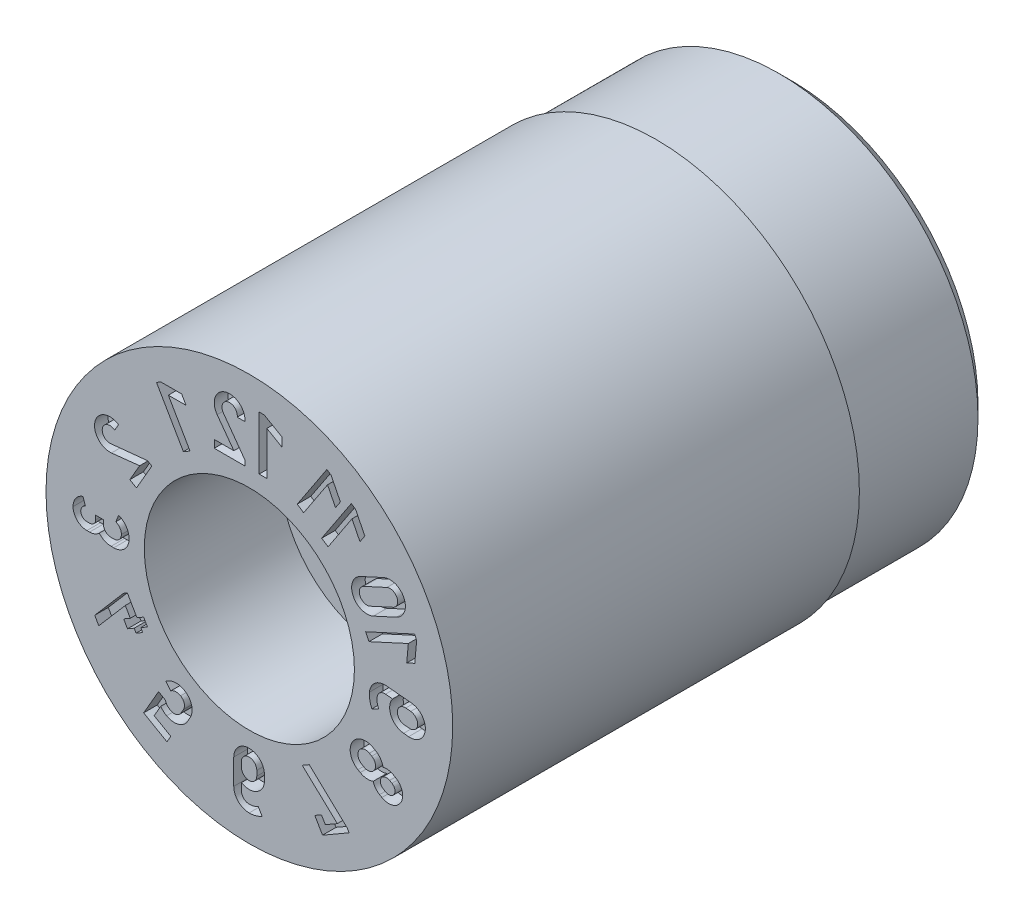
from build123d import *

# Parameters (mm, degrees)
SKETCH4_W          = 2
SKETCH4_H          = 1
CUT_EXTRUDE1_DEPTH = 0.2


with BuildPart() as part:
    # Sketch1 → Revolve1 (revolve)
    with BuildSketch(Plane(origin=(0, 0, 0), x_dir=(0, 0, -1), z_dir=(1, 0, 0)), mode=Mode.PRIVATE) as revolve1_sk:
        Polygon((0, 3), (0, 1.55), (2, 1.55), (2, 0.8), (8, 0.8), (8, 2.75), (7.75, 3), align=None)
    revolve(revolve1_sk.sketch.rotate(Axis((0, 0, 3.797909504), (0, 0, -1)), 90), axis=Axis((0, 0, 3.797909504), (0, 0, -1)))

    # Sketch4 → Cut-Revolve1 (revolve, cut)
    with BuildSketch(Plane(origin=(0, 0, 0), x_dir=(0, 0, -1), z_dir=(1, 0, 0)), mode=Mode.PRIVATE) as cut_revolve1_sk:
        with Locations((7, 3.435)):
            Rectangle(SKETCH4_W, SKETCH4_H)
    revolve(cut_revolve1_sk.sketch.rotate(Axis((0, 0, 0), (0, 0, -1)), 90), axis=Axis((0, 0, 0), (0, 0, -1)), mode=Mode.SUBTRACT)

    # Sketch2 → Cut-Extrude1 (cut)
    # profile 1 of 15: a face of its own
    with BuildSketch(Plane.XY):
        Polygon((1.504540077, 2.099663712), (1.56676782, 2.05853547), (1.703996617, 1.784946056), (1.631939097, 1.675921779), (1.514703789, 1.909561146), (1.161711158, 1.375477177), (1.067191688, 1.437948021), align=None)
    # profile 2 of 15: a face of its own
    with BuildSketch(Plane.XY):
        Polygon((1.143710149, 2.354168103), (1.205937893, 2.31303986), (1.34316669, 2.039450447), (1.27110917, 1.93042617), (1.153873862, 2.164065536), (0.80088123, 1.629981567), (0.706361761, 1.692452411), align=None)
    # profile 3 of 15: a face of its own
    with BuildSketch(Plane.XY):
        with BuildLine():
            Line((2.391484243, -0.005118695), (2.019163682, 0.029559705))
            ThreePointArc((2.019163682, 0.029559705), (1.853456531, -0.021646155), (1.772455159, -0.175007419))
            ThreePointArc((1.772455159, -0.175007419), (1.776698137, -0.275805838), (1.807754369, -0.371794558))
            Line((1.807754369, -0.371794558), (1.910064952, -0.322612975))
            ThreePointArc((1.910064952, -0.322612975), (1.886093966, -0.251740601), (1.886419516, -0.176924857))
            ThreePointArc((1.886419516, -0.176924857), (1.929158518, -0.106137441), (2.008617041, -0.083250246))
            Line((2.008617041, -0.083250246), (2.112173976, -0.092922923))
            ThreePointArc((2.112173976, -0.092922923), (2.090630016, -0.318872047), (2.276014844, -0.449828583))
            Line((2.276014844, -0.449828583), (2.349218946, -0.456404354))
            ThreePointArc((2.349218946, -0.456404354), (2.595994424, -0.251894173), (2.391484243, -0.005118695))
        make_face()
        with BuildLine():
            Line((2.380951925, -0.117990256), (2.307631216, -0.111148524))
            ThreePointArc((2.307631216, -0.111148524), (2.184278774, -0.213448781), (2.286583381, -0.336797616))
            Line((2.286583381, -0.336797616), (2.359888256, -0.343637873))
            ThreePointArc((2.359888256, -0.343637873), (2.483243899, -0.241345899), (2.380951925, -0.117990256))
        make_face(mode=Mode.SUBTRACT)
    # profile 4 of 15: a face of its own
    with BuildSketch(Plane.XY):
        Polygon((0.780813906, -1.606569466), (0.883247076, -1.547429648), (1.444601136, -2.076428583), (1.471791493, -2.123523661), (1.079259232, -2.350152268), (0.965944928, -2.153886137), (1.064091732, -2.097221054), (1.120740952, -2.195340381), (1.297361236, -2.093368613), align=None)
    # profile 5 of 15: a face of its own
    with BuildSketch(Plane.XY):
        with BuildLine():
            Line((1.862289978, -0.878798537), (1.827973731, -0.858949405))
            ThreePointArc((1.827973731, -0.858949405), (1.518236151, -0.941810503), (1.601345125, -1.251481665))
            Line((1.601345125, -1.251481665), (1.635665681, -1.271296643))
            ThreePointArc((1.635665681, -1.271296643), (1.729541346, -1.300831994), (1.827084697, -1.287783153))
            ThreePointArc((1.827084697, -1.287783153), (1.862355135, -1.358397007), (1.921768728, -1.410361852))
            Line((1.921768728, -1.410361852), (1.956123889, -1.430163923))
            ThreePointArc((1.956123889, -1.430163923), (2.234666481, -1.355512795), (2.160015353, -1.076970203))
            Line((2.160015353, -1.076970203), (2.125744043, -1.057037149))
            ThreePointArc((2.125744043, -1.057037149), (2.05107211, -1.031419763), (1.972280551, -1.03632264))
            ThreePointArc((1.972280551, -1.03632264), (1.934803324, -0.945328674), (1.862289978, -0.878798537))
        make_face()
        with BuildLine():
            Line((1.978413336, -1.312240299), (2.01276804, -1.332038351))
            ThreePointArc((2.01276804, -1.332038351), (2.136591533, -1.298859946), (2.103413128, -1.175036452))
            Line((2.103413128, -1.175036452), (2.06909016, -1.155183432))
            ThreePointArc((2.06909016, -1.155183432), (1.945097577, -1.188300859), (1.978413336, -1.312240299))
        make_face(mode=Mode.SUBTRACT)
        with BuildLine():
            Line((1.657975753, -1.153356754), (1.692347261, -1.173201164))
            ThreePointArc((1.692347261, -1.173201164), (1.847111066, -1.131713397), (1.8056233, -0.976949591))
            Line((1.8056233, -0.976949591), (1.77130591, -0.957063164))
            ThreePointArc((1.77130591, -0.957063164), (1.616535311, -0.99856871), (1.657975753, -1.153356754))
        make_face(mode=Mode.SUBTRACT)
    # profile 6 of 15: a face of its own
    with BuildSketch(Plane.XY):
        Polygon((2.437380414, 0.898792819), (2.468512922, 0.831009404), (2.440605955, 0.526207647), (2.321848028, 0.471662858), (2.345641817, 0.731980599), (1.763875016, 0.464778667), (1.716586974, 0.567736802), align=None)
    # profile 7 of 15: a face of its own
    with BuildSketch(Plane.XY):
        with BuildLine():
            Line((1.980886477, 1.392370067), (1.641083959, 1.236300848))
            ThreePointArc((1.641083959, 1.236300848), (1.52969504, 0.935721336), (1.830280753, 0.824349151))
            Line((1.830280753, 0.824349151), (2.170091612, 0.9804222))
            ThreePointArc((2.170091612, 0.9804222), (2.281462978, 1.280998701), (1.980886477, 1.392370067))
        make_face()
        with BuildLine():
            Line((1.782979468, 0.927336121), (2.122790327, 1.08340917))
            ThreePointArc((2.122790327, 1.08340917), (2.178476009, 1.233697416), (2.028187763, 1.289383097))
            Line((2.028187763, 1.289383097), (1.688369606, 1.133306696))
            ThreePointArc((1.688369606, 1.133306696), (1.632685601, 0.983014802), (1.782979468, 0.927336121))
        make_face(mode=Mode.SUBTRACT)
    # profile 8 of 15: a face of its own
    with BuildSketch(Plane.XY):
        Polygon((0.145054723, 2.589659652), (0.219645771, 2.589659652), (0.484981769, 2.437082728), (0.484981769, 2.306397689), (0.258353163, 2.436670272), (0.258353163, 1.796475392), (0.145054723, 1.796475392), align=None)
    # profile 9 of 15: a face of its own
    with BuildSketch(Plane.XY):
        with BuildLine():
            Line((-0.517439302, 1.794737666), (-0.064182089, 1.794737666))
            Line((-0.064182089, 1.794737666), (-0.064182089, 1.869677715))
            Line((-0.064182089, 1.869677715), (-0.38282007, 2.31205244))
            ThreePointArc((-0.38282007, 2.31205244), (-0.317437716, 2.488485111), (-0.178781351, 2.361293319))
            Line((-0.178781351, 2.361293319), (-0.064811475, 2.36129041))
            ThreePointArc((-0.064811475, 2.36129041), (-0.352403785, 2.59639621), (-0.474915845, 2.245718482))
            Line((-0.474915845, 2.245718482), (-0.228466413, 1.908067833))
            Line((-0.228466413, 1.908067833), (-0.517439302, 1.908067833))
            Line((-0.517439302, 1.908067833), (-0.517439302, 1.794737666))
        make_face()
    # profile 10 of 15: a face of its own
    with BuildSketch(Plane.XY):
        Polygon((-1.369741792, 2.210563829), (-1.30514405, 2.247859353), (-0.999067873, 2.24839186), (-0.933725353, 2.135215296), (-1.195127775, 2.134720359), (-0.875030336, 1.58029533), (-0.973149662, 1.52364611), align=None)
    # profile 11 of 15: a face of its own
    with BuildSketch(Plane.XY):
        with BuildLine():
            Line((0.223004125, -2.006818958), (0.223258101, -2.080317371))
            ThreePointArc((0.223258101, -2.080317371), (0.110091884, -2.277067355), (-0.116881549, -2.276609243))
            Line((-0.116881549, -2.276609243), (-0.116891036, -2.380616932))
            ThreePointArc((-0.116891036, -2.380616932), (-0.086720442, -2.457605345), (-0.012268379, -2.493582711))
            ThreePointArc((-0.012268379, -2.493582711), (0.062248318, -2.486956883), (0.130582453, -2.456508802))
            Line((0.130582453, -2.456508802), (0.189070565, -2.553815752))
            ThreePointArc((0.189070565, -2.553815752), (0.096382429, -2.593655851), (-0.003585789, -2.607245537))
            ThreePointArc((-0.003585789, -2.607245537), (-0.163809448, -2.540843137), (-0.230189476, -2.380610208))
            Line((-0.230189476, -2.380610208), (-0.230252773, -2.006664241))
            ThreePointArc((-0.230252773, -2.006664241), (-0.003546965, -1.780113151), (0.223004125, -2.006818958))
        make_face()
        with BuildLine():
            Line((-0.116891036, -2.006678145), (-0.116891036, -2.080317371))
            ThreePointArc((-0.116891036, -2.080317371), (-0.003572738, -2.193631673), (0.109737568, -2.08030938))
            Line((0.109737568, -2.08030938), (0.109737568, -2.006686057))
            ThreePointArc((0.109737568, -2.006686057), (-0.003572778, -1.893367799), (-0.116891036, -2.006678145))
        make_face(mode=Mode.SUBTRACT)
    # profile 12 of 15: a face of its own
    with BuildSketch(Plane.XY):
        with BuildLine():
            Line((-1.307500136, -1.897256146), (-1.404300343, -2.064919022))
            Line((-1.404300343, -2.064919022), (-1.158961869, -2.206565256))
            Line((-1.158961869, -2.206565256), (-1.215629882, -2.304717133))
            Line((-1.215629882, -2.304717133), (-1.559088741, -2.106421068))
            Line((-1.559088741, -2.106421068), (-1.339154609, -1.725483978))
            Line((-1.339154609, -1.725483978), (-1.241035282, -1.782133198))
            ThreePointArc((-1.241035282, -1.782133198), (-1.211462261, -1.836248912), (-1.164540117, -1.87626624))
            ThreePointArc((-1.164540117, -1.87626624), (-1.078560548, -1.887592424), (-1.009777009, -1.83477582))
            Line((-1.009777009, -1.83477582), (-0.972924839, -1.771009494))
            ThreePointArc((-0.972924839, -1.771009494), (-0.961588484, -1.685019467), (-1.014411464, -1.616226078))
            ThreePointArc((-1.014411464, -1.616226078), (-1.089186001, -1.5991495), (-1.160626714, -1.627061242))
            Line((-1.160626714, -1.627061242), (-1.231173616, -1.538265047))
            ThreePointArc((-1.231173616, -1.538265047), (-1.097577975, -1.48602976), (-0.957758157, -1.518072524))
            ThreePointArc((-0.957758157, -1.518072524), (-0.852225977, -1.655703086), (-0.87480656, -1.827660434))
            Line((-0.87480656, -1.827660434), (-0.911697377, -1.89136685))
            ThreePointArc((-0.911697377, -1.89136685), (-1.049302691, -1.996836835), (-1.221216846, -1.974372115))
            ThreePointArc((-1.221216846, -1.974372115), (-1.26837267, -1.940305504), (-1.307500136, -1.897256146))
        make_face()
    # profile 13 of 15: a face of its own
    with BuildSketch(Plane.XY):
        with BuildLine():
            Line((-2.00050738, -0.105027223), (-2.040167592, -0.105027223))
            ThreePointArc((-2.040167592, -0.105027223), (-2.120272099, -0.071846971), (-2.15345249, 0.008257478))
            Line((-2.15345249, 0.008257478), (-2.15345249, 0.064904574))
            Line((-2.15345249, 0.064904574), (-2.266782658, 0.064904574))
            Line((-2.266782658, 0.064904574), (-2.266782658, 0.008271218))
            ThreePointArc((-2.266782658, 0.008271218), (-2.293331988, -0.05582455), (-2.357427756, -0.082373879))
            Line((-2.357427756, -0.082373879), (-2.39708248, -0.082373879))
            ThreePointArc((-2.39708248, -0.082373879), (-2.461155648, -0.055802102), (-2.487732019, 0.008269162))
            ThreePointArc((-2.487732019, 0.008269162), (-2.468633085, 0.067742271), (-2.418407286, 0.104879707))
            Line((-2.418407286, 0.104879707), (-2.454672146, 0.212246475))
            ThreePointArc((-2.454672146, 0.212246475), (-2.560655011, 0.133802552), (-2.601048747, 0.008286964))
            ThreePointArc((-2.601048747, 0.008286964), (-2.541319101, -0.135964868), (-2.397071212, -0.195704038))
            Line((-2.397071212, -0.195704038), (-2.357427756, -0.195704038))
            ThreePointArc((-2.357427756, -0.195704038), (-2.280011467, -0.180434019), (-2.214191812, -0.136911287))
            ThreePointArc((-2.214191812, -0.136911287), (-2.136240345, -0.196999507), (-2.040162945, -0.218357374))
            Line((-2.040162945, -0.218357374), (-2.000488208, -0.218357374))
            ThreePointArc((-2.000488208, -0.218357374), (-1.84025356, -0.151979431), (-1.773897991, 0.008264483))
            ThreePointArc((-1.773897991, 0.008264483), (-1.816118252, 0.145324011), (-1.928117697, 0.23490073))
            Line((-1.928117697, 0.23490073), (-1.969693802, 0.129521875))
            ThreePointArc((-1.969693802, 0.129521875), (-1.909776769, 0.081605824), (-1.887196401, 0.008283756))
            ThreePointArc((-1.887196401, 0.008283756), (-1.920384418, -0.071839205), (-2.00050738, -0.105027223))
        make_face()
    # profile 14 of 15: a face of its own
    with BuildSketch(Plane.XY):
        Polygon((-2.280994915, -1.220594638), (-2.220982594, -1.324539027), (-1.829479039, -0.869531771), (-1.756077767, -0.996666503), (-1.854197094, -1.053315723), (-1.797547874, -1.151435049), (-1.699428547, -1.09478583), (-1.671096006, -1.143859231), (-1.572976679, -1.087210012), (-1.60130922, -1.03813661), (-1.503162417, -0.981471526), (-1.559811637, -0.883352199), (-1.65795844, -0.940017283), (-1.799605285, -0.694677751), (-1.856976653, -0.727801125), align=None)
    # profile 15 of 15: a face of its own
    with BuildSketch(Plane.XY):
        with BuildLine():
            Line((-1.763263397, 0.7709188), (-1.665116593, 0.714253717))
            Line((-1.665116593, 0.714253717), (-1.438487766, 1.10678636))
            Line((-1.438487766, 1.10678636), (-1.503386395, 1.144255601))
            Line((-1.503386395, 1.144255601), (-2.045813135, 1.089494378))
            ThreePointArc((-2.045813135, 1.089494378), (-2.16591142, 1.234326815), (-1.986440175, 1.290807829))
            Line((-1.986440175, 1.290807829), (-1.92945527, 1.389513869))
            ThreePointArc((-1.92945527, 1.389513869), (-2.276852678, 1.258003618), (-2.034415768, 0.976571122))
            Line((-2.034415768, 0.976571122), (-1.618776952, 1.021176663))
            Line((-1.618776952, 1.021176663), (-1.763263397, 0.7709188))
        make_face()
    extrude(amount=-CUT_EXTRUDE1_DEPTH, mode=Mode.SUBTRACT)


solid = part.part
